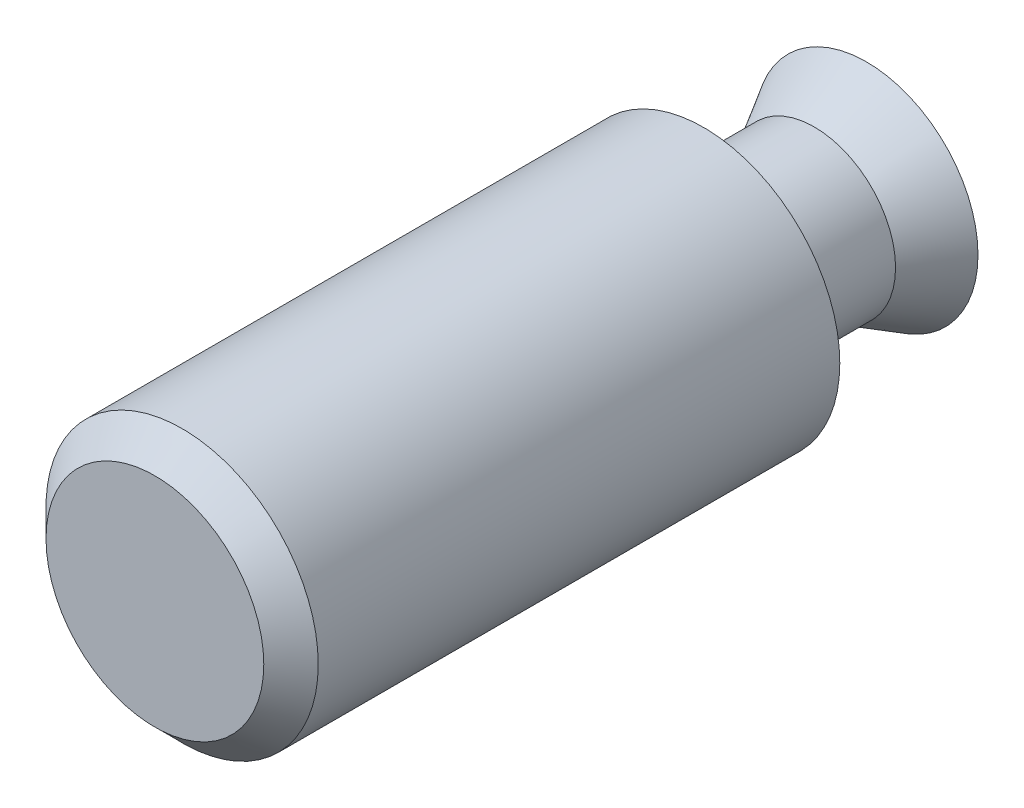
from build123d import *


with BuildPart() as part:
    # Sketch 1 → Revolve 1 (revolve)
    with BuildSketch(Plane(origin=(0, 0, 0), x_dir=(0, 0, -1), z_dir=(1, 0, 0)), mode=Mode.PRIVATE) as revolve_1_sk:
        Polygon((0, 0), (0, 3.175), (0.79375, 3.96875), (16.002, 3.96875), (16.002, 2.36855), (19.2278, 2.36855), (20.7518, 3.24843181), (20.7518, 0), align=None)
    revolve(revolve_1_sk.sketch.rotate(Axis((0, 0, 0), (0, 0, -1)), 90), axis=Axis((0, 0, 0), (0, 0, -1)))


solid = part.part
